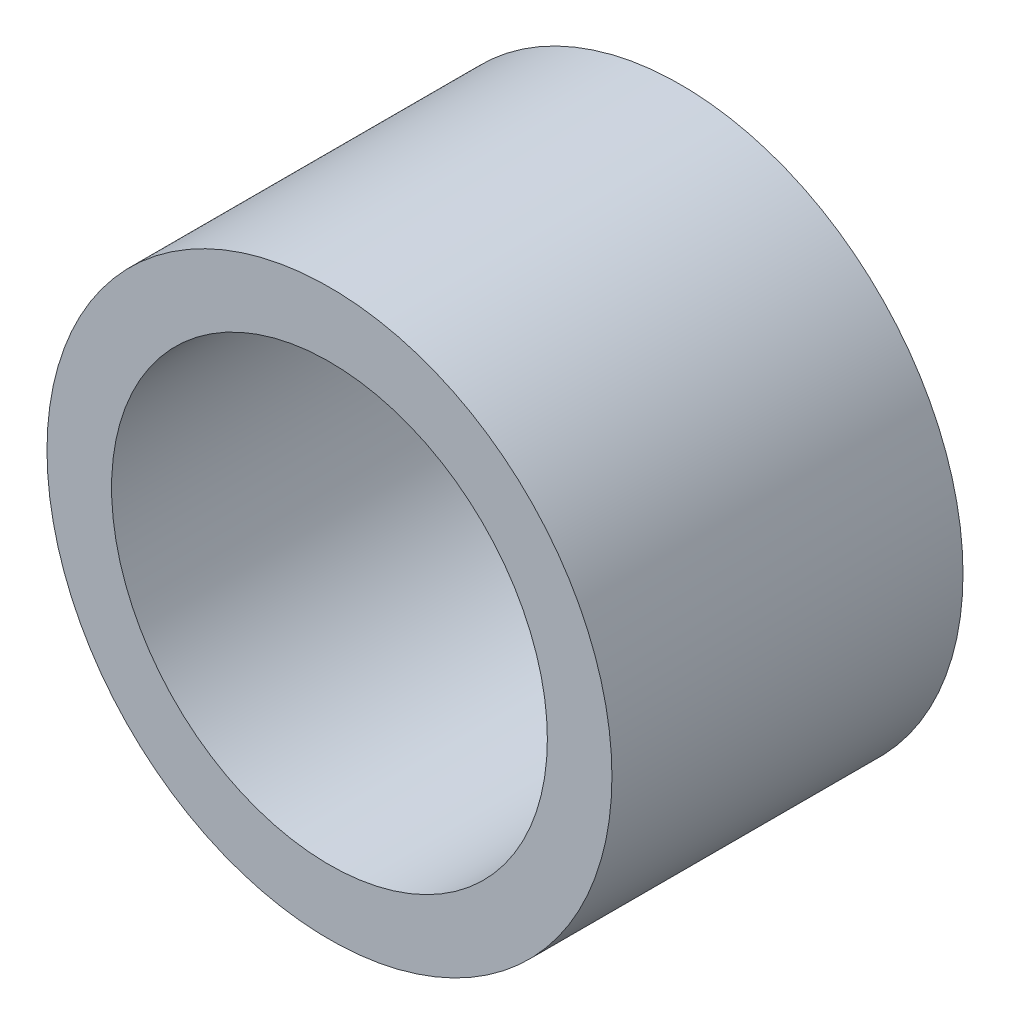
from build123d import *

# Parameters (mm, degrees)
ESQUISSE1_R      = 17.5
ESQUISSE1_R_2    = 13.5
EXTRUSION1_DEPTH = 21.75


with BuildPart() as part:
    # Esquisse1 → Extrusion1 (new body)
    with BuildSketch(Plane.XY):
        Circle(ESQUISSE1_R)
        Circle(ESQUISSE1_R_2, mode=Mode.SUBTRACT)
    extrude(amount=EXTRUSION1_DEPTH)


solid = part.part
